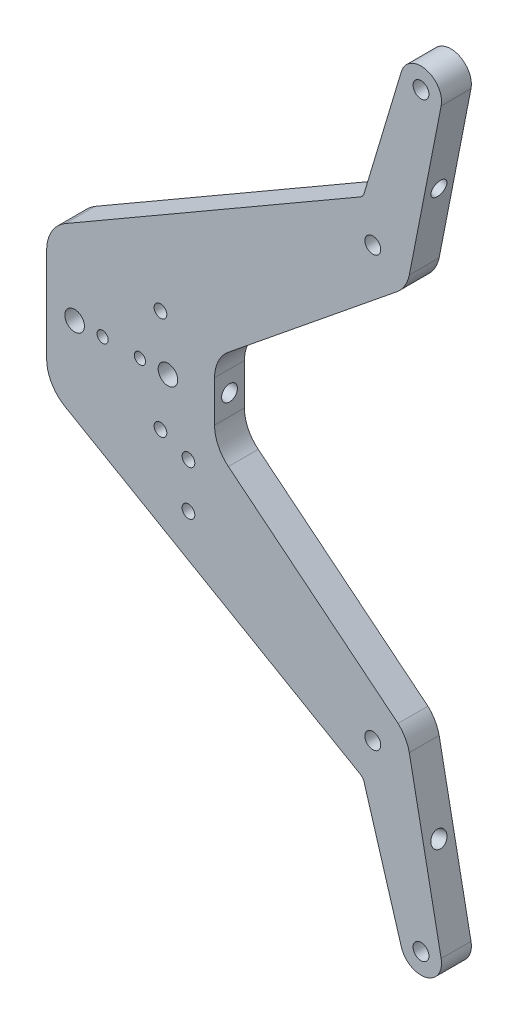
from build123d import *

# Parameters (mm, degrees)
BOSS_EXTRU_1_DEPTH                = 16
TROU_TARAUD_M101_AT_2_COUNT       = 2
TROU_TARAUD_M101_AT_2_PITCH       = 88.8381932
TROU_TARAUD_M103_D                = 8.5
DIAM_TRE_DU_PER_AGE_10_5_10_5_1_D = 10.5
TROU_TARAUD_M81_D                 = 6.8
TROU_TARAUD_M102_REACH            = 246.075
TROU_TARAUD_M102_BORE_R           = 4.25
DIAM_TRE_DU_PER_AGE_6_0_6_1_D     = 6
DIAM_TRE_DU_PER_AGE_6_0_6_1_DEPTH = 6
DIAM_TRE_DU_PER_AGE_6_0_6_1_TIP   = 1.802581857


with BuildPart() as part:
    # Esquisse1 → Boss.-Extru.1 (new body)
    with BuildSketch(Plane.XY):
        with BuildLine():
            Line((-65.096740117, -26.534546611), (25.829376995, -100.265225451))
            ThreePointArc((25.829376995, -100.265225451), (29.672159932, -105.079795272), (31.867439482, -110.835471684))
            Line((31.867439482, -110.835471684), (48.931078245, -197.884002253))
            ThreePointArc((48.931078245, -197.884002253), (40.777300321, -210.678308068), (27.599958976, -203.159263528))
            Line((27.599958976, -203.159263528), (7.632747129, -136.565994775))
            ThreePointArc((7.632747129, -136.565994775), (6.853936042, -135.070456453), (5.578586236, -133.967431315))
            Line((5.578586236, -133.967431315), (-152.511514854, -42.553854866))
            ThreePointArc((-152.511514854, -42.553854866), (-159.823831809, -35.234240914), (-162.5, -25.24))
            Line((-162.5, -25.24), (-162.5, 25.24))
            ThreePointArc((-162.5, 25.24), (-159.823831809, 35.234240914), (-152.511514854, 42.553854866))
            Line((-152.511514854, 42.553854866), (5.578586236, 133.967431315))
            ThreePointArc((5.578586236, 133.967431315), (6.853936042, 135.070456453), (7.632747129, 136.565994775))
            Line((7.632747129, 136.565994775), (27.599958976, 203.159263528))
            ThreePointArc((27.599958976, 203.159263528), (40.777300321, 210.678308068), (48.931078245, 197.884002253))
            Line((48.931078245, 197.884002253), (31.867439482, 110.835471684))
            ThreePointArc((31.867439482, 110.835471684), (29.672159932, 105.079795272), (25.829376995, 100.265225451))
            Line((25.829376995, 100.265225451), (-65.096740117, 26.534546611))
            ThreePointArc((-65.096740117, 26.534546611), (-70.554567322, 19.604219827), (-72.5, 11))
            Line((-72.5, 11), (-72.5, -11))
            ThreePointArc((-72.5, -11), (-70.554567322, -19.604219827), (-65.096740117, -26.534546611))
        make_face()
    extrude(amount=BOSS_EXTRU_1_DEPTH)

    # Esquisse3 → Trou taraud_ M101 (revolve, cut)
    with BuildSketch(Plane(origin=(38.13651695, 200, 16), x_dir=(0, -1, 0), z_dir=(1, 0, 0))):
        Polygon((0, 0), (0, 30.053657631), (4.25, 27.5), (4.25, 0), align=None)
    trou_taraud_m101 = revolve(axis=Axis((38.13651695, 200, 22.35), (0, 0, -1)), mode=Mode.SUBTRACT)

    # Trou taraud_ M101 at 2: Trou taraud_ M101 ×2
    with Locations(*[Vector(-0.29076109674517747, -0.9567956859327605, 0) * (i * TROU_TARAUD_M101_AT_2_PITCH) for i in range(1, TROU_TARAUD_M101_AT_2_COUNT)]):
        add(trou_taraud_m101, mode=Mode.SUBTRACT)

    # Trou taraud_ M103 (through all)
    with Locations(Plane(origin=(-30.566910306, 9.165130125, 0), x_dir=(0, 0, 1), z_dir=(-0.9578689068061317, 0.2872057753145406, 0))):
        with Locations((8, 156.004489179)):
            trou_taraud_m103 = Hole(TROU_TARAUD_M103_D / 2)

    # Sym_trie1: Trou taraud_ M101, Trou taraud_ M103 across plane
    add(trou_taraud_m101.mirror(Plane.ZX), mode=Mode.SUBTRACT)
    add(trou_taraud_m103.mirror(Plane.ZX), mode=Mode.SUBTRACT)

    # Sym_trie1 copy 1 sketch → Sym_trie1 copy 1 (revolve, cut)
    with BuildSketch(Plane(origin=(12.305826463, -115, 16), x_dir=(0, 1, 0), z_dir=(1, 0, 0))):
        Polygon((0, 0), (0, -30.053657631), (4.25, -27.5), (4.25, 0), align=None)
    revolve(axis=Axis((12.305826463, -115, 22.35), (0, 0, 1)), mode=Mode.SUBTRACT)

    # Diam_tre du per_age _10.5 _10.5_1 (through all)
    with Locations(Plane.XY.offset(16)):
        with Locations((-147.5, 0), (-97.5, 0)):
            Hole(DIAM_TRE_DU_PER_AGE_10_5_10_5_1_D / 2)

    # Trou taraud_ M81 (through all)
    with Locations(Plane.XY.offset(16)):
        with Locations((-101.5, 27.5), (-101.5, -27.5), (-86.5, -34), (-86.5, -58)):
            Hole(TROU_TARAUD_M81_D / 2)

    # Trou taraud_ M102 bore → Trou taraud_ M102 (cut, up to next)
    with BuildSketch(Plane(origin=(-72.5, 0, 0), x_dir=(0, 0, -1), z_dir=(1, 0, 0)), mode=Mode.PRIVATE) as trou_taraud_m102_sk1:
        with Locations((-8, 0)):
            Circle(TROU_TARAUD_M102_BORE_R)
    trou_taraud_m102_tool1 = extrude(trou_taraud_m102_sk1.sketch, amount=-TROU_TARAUD_M102_REACH, mode=Mode.PRIVATE) & part.part
    add(trou_taraud_m102_tool1.solids().sort_by_distance((-72.5, 0, 8))[0], mode=Mode.SUBTRACT)

    # Diam_tre du per_age _6.0 _6_1
    with Locations(Plane.XY.offset(16)):
        with Locations((-132.5, 0), (-112.5, 0)):
            Hole(DIAM_TRE_DU_PER_AGE_6_0_6_1_D / 2, depth=DIAM_TRE_DU_PER_AGE_6_0_6_1_DEPTH)
            with Locations((0, 0, -(DIAM_TRE_DU_PER_AGE_6_0_6_1_DEPTH + DIAM_TRE_DU_PER_AGE_6_0_6_1_TIP / 2))):  # 118° drill point
                Cone(0, DIAM_TRE_DU_PER_AGE_6_0_6_1_D / 2, DIAM_TRE_DU_PER_AGE_6_0_6_1_TIP, mode=Mode.SUBTRACT)


solid = part.part
